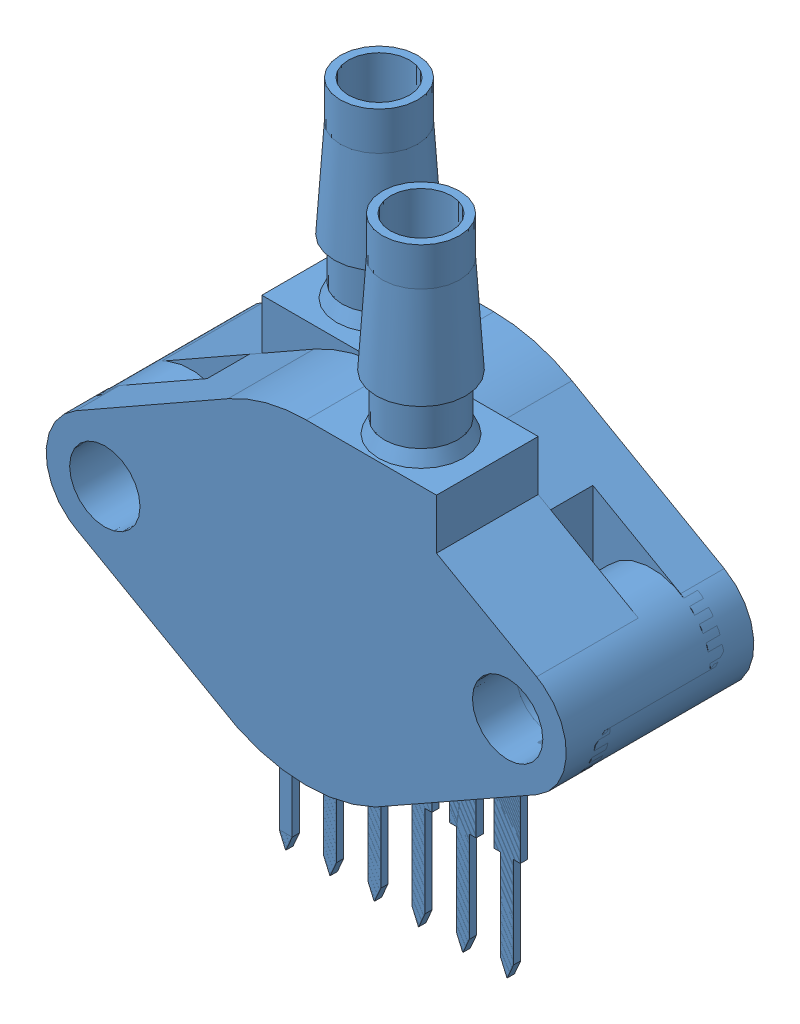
SolidWorks assembly MPX5010.SLDASM, configuration Valor predeterminado (file format 4700). Lengths in mm.
Overall size (29.85 38.08 10.76).
2 component instances, 1 part files, 3 mates.
Components (placement in the parent):
- MPX5010GP-1: MPX5010GP.SLDPRT [Valor predeterminado] at (-388.394 -170.6457 -4.5775) size (29.85 38.08 9.15)
- MPX5010GP-2: MPX5010GP.SLDPRT [Valor predeterminado] at (274.5469 -170.6457 6.1825) x (-1 0 0) z (0 0 -1) size (29.85 38.08 9.15)
Mates (geometry in assembly coordinates):
- Concêntrico1: concentric: cylinder of MPX5010GP-1 through (-68.4785 12.7598 3.6825) axis (0 0 -1) radius 2.02; cylinder of MPX5010GP-2 through (-68.4785 12.7598 -2.0775) axis (0 0 1) radius 2.02
- Coincidente2: coincident: plane of MPX5010GP-1 through (-388.394 -170.6457 0.5975) normal (0 0 -1); plane of MPX5010GP-2 through (291.3479 -134.9863 0.5975) normal (0 0 -1)
- Concêntrico2: concentric anti-aligned: cylinder of MPX5010GP-1 through (-45.3685 12.7598 3.6825) axis (0 0 -1) radius 2.02; cylinder of MPX5010GP-2 through (-45.3685 12.7598 -2.0775) axis (0 0 1) radius 2.02
